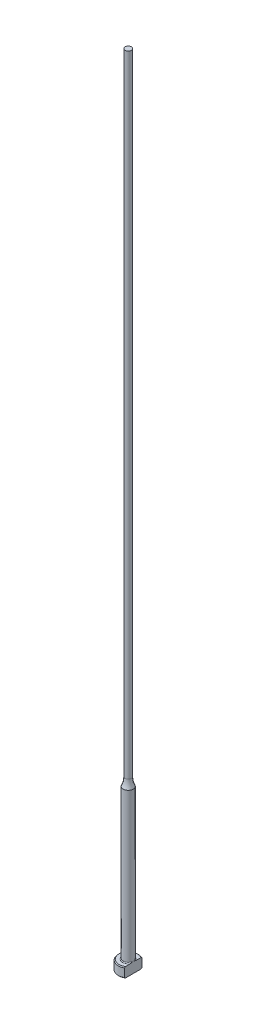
ISO-10303-21;
HEADER;
FILE_DESCRIPTION(('STEP AP214'),'2;1');
FILE_NAME('part.step','',(''),(''),'','','');
FILE_SCHEMA(('AUTOMOTIVE_DESIGN { 1 0 10303 214 1 1 1 1 }'));
ENDSEC;
DATA;
#1=APPLICATION_CONTEXT('core data for automotive mechanical design processes');
#2=APPLICATION_PROTOCOL_DEFINITION('international standard','automotive_design',2000,#1);
#3=PRODUCT_CONTEXT('',#1,'mechanical');
#4=PRODUCT('Part','Part','',(#3));
#5=PRODUCT_RELATED_PRODUCT_CATEGORY('part','',(#4));
#6=PRODUCT_DEFINITION_FORMATION('','',#4);
#7=PRODUCT_DEFINITION_CONTEXT('part definition',#1,'design');
#8=PRODUCT_DEFINITION('design','',#6,#7);
#9=PRODUCT_DEFINITION_SHAPE('','',#8);
#10=(LENGTH_UNIT() NAMED_UNIT(*) SI_UNIT(.MILLI.,.METRE.));
#11=(NAMED_UNIT(*) PLANE_ANGLE_UNIT() SI_UNIT($,.RADIAN.));
#12=(NAMED_UNIT(*) SI_UNIT($,.STERADIAN.) SOLID_ANGLE_UNIT());
#13=UNCERTAINTY_MEASURE_WITH_UNIT(LENGTH_MEASURE(1.E-05),#10,'distance_accuracy_value','');
#14=(GEOMETRIC_REPRESENTATION_CONTEXT(3) GLOBAL_UNCERTAINTY_ASSIGNED_CONTEXT((#13)) GLOBAL_UNIT_ASSIGNED_CONTEXT((#10,
#11,#12)) REPRESENTATION_CONTEXT('',''));
#15=CARTESIAN_POINT('',(0.,0.,0.));
#16=DIRECTION('',(0.,0.,1.));
#17=DIRECTION('',(1.,0.,0.));
#18=AXIS2_PLACEMENT_3D('',#15,#16,#17);
#19=CARTESIAN_POINT('',(-3.17499999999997,3.175,0.));
#20=DIRECTION('',(0.,1.,0.));
#21=DIRECTION('',(0.,0.,1.));
#22=AXIS2_PLACEMENT_3D('',#19,#20,#21);
#23=PLANE('',#22);
#24=CARTESIAN_POINT('',(0.,3.175,0.));
#25=DIRECTION('',(0.,1.,0.));
#26=DIRECTION('',(0.,0.,1.));
#27=AXIS2_PLACEMENT_3D('',#24,#25,#26);
#28=CIRCLE('',#27,2.92099999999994);
#29=CARTESIAN_POINT('',(1.58749999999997,3.175,-2.45195529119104));
#30=VERTEX_POINT('',#29);
#31=CARTESIAN_POINT('',(1.58749999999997,3.175,2.45195529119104));
#32=VERTEX_POINT('',#31);
#33=EDGE_CURVE('E105',#30,#32,#28,.T.);
#34=ORIENTED_EDGE('',*,*,#33,.T.);
#35=DIRECTION('',(0.,0.,1.));
#36=VECTOR('',#35,1.);
#37=CARTESIAN_POINT('',(1.58749999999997,3.17499999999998,2.74963065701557));
#38=LINE('',#37,#36);
#39=CARTESIAN_POINT('',(1.58749999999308,3.175,0.933255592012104));
#40=VERTEX_POINT('',#39);
#41=EDGE_CURVE('E126',#40,#32,#38,.T.);
#42=ORIENTED_EDGE('',*,*,#41,.F.);
#43=CARTESIAN_POINT('',(0.,3.175,0.));
#44=DIRECTION('',(0.,1.,0.));
#45=DIRECTION('',(0.,0.,1.));
#46=AXIS2_PLACEMENT_3D('',#43,#44,#45);
#47=CIRCLE('',#46,1.84149999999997);
#48=CARTESIAN_POINT('',(1.58749999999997,3.17500000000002,-0.933255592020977));
#49=VERTEX_POINT('',#48);
#50=EDGE_CURVE('E11',#40,#49,#47,.F.);
#51=ORIENTED_EDGE('',*,*,#50,.T.);
#52=EDGE_CURVE('E52',#30,#49,#38,.T.);
#53=ORIENTED_EDGE('',*,*,#52,.F.);
#54=EDGE_LOOP('',(#34,#42,#51,#53));
#55=FACE_BOUND('',#54,.T.);
#56=ADVANCED_FACE('F32',(#55),#23,.T.);
#57=CARTESIAN_POINT('',(0.,259.958771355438,0.));
#58=DIRECTION('',(0.,1.,0.));
#59=DIRECTION('',(0.,0.,1.));
#60=AXIS2_PLACEMENT_3D('',#57,#58,#59);
#61=CYLINDRICAL_SURFACE('',#60,3.17499999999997);
#62=CARTESIAN_POINT('',(0.,2.92100000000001,0.));
#63=DIRECTION('',(0.,1.,0.));
#64=DIRECTION('',(0.,0.,1.));
#65=AXIS2_PLACEMENT_3D('',#62,#63,#64);
#66=CIRCLE('',#65,3.17499999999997);
#67=CARTESIAN_POINT('',(1.58749999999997,2.92100000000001,2.74963065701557));
#68=VERTEX_POINT('',#67);
#69=CARTESIAN_POINT('',(1.58749999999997,2.92100000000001,-2.74963065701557));
#70=VERTEX_POINT('',#69);
#71=EDGE_CURVE('E98',#68,#70,#66,.F.);
#72=ORIENTED_EDGE('',*,*,#71,.T.);
#73=DIRECTION('',(0.,-1.,0.));
#74=VECTOR('',#73,1.);
#75=CARTESIAN_POINT('',(1.58749999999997,254.001,-2.74963065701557));
#76=LINE('',#75,#74);
#77=CARTESIAN_POINT('',(1.58749999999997,0.253999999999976,-2.74963065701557));
#78=VERTEX_POINT('',#77);
#79=EDGE_CURVE('E141',#70,#78,#76,.T.);
#80=ORIENTED_EDGE('',*,*,#79,.T.);
#81=CARTESIAN_POINT('',(0.,0.253999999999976,0.));
#82=DIRECTION('',(0.,-1.,0.));
#83=DIRECTION('',(0.,0.,-1.));
#84=AXIS2_PLACEMENT_3D('',#81,#82,#83);
#85=CIRCLE('',#84,3.17499999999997);
#86=CARTESIAN_POINT('',(1.58749999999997,0.253999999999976,2.74963065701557));
#87=VERTEX_POINT('',#86);
#88=EDGE_CURVE('E95',#78,#87,#85,.F.);
#89=ORIENTED_EDGE('',*,*,#88,.T.);
#90=DIRECTION('',(0.,-1.,0.));
#91=VECTOR('',#90,1.);
#92=CARTESIAN_POINT('',(1.58749999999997,254.001,2.74963065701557));
#93=LINE('',#92,#91);
#94=EDGE_CURVE('E88',#68,#87,#93,.T.);
#95=ORIENTED_EDGE('',*,*,#94,.F.);
#96=EDGE_LOOP('',(#72,#80,#89,#95));
#97=FACE_BOUND('',#96,.T.);
#98=ADVANCED_FACE('F191',(#97),#61,.T.);
#99=CARTESIAN_POINT('',(0.,0.,0.));
#100=DIRECTION('',(0.,-1.,0.));
#101=DIRECTION('',(0.,0.,-1.));
#102=AXIS2_PLACEMENT_3D('',#99,#100,#101);
#103=PLANE('',#102);
#104=CARTESIAN_POINT('',(0.,0.,0.));
#105=DIRECTION('',(0.,-1.,0.));
#106=DIRECTION('',(0.,0.,-1.));
#107=AXIS2_PLACEMENT_3D('',#104,#105,#106);
#108=CIRCLE('',#107,2.92100000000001);
#109=CARTESIAN_POINT('',(1.58749999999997,0.,2.45195529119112));
#110=VERTEX_POINT('',#109);
#111=CARTESIAN_POINT('',(1.58749999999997,0.,-2.45195529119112));
#112=VERTEX_POINT('',#111);
#113=EDGE_CURVE('E93',#110,#112,#108,.T.);
#114=ORIENTED_EDGE('',*,*,#113,.T.);
#115=DIRECTION('',(0.,0.,1.));
#116=VECTOR('',#115,1.);
#117=CARTESIAN_POINT('',(1.58749999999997,0.,2.74963065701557));
#118=LINE('',#117,#116);
#119=EDGE_CURVE('E78',#112,#110,#118,.T.);
#120=ORIENTED_EDGE('',*,*,#119,.T.);
#121=EDGE_LOOP('',(#114,#120));
#122=FACE_BOUND('',#121,.T.);
#123=ADVANCED_FACE('F97',(#122),#103,.T.);
#124=CARTESIAN_POINT('',(0.,3.17499999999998,0.));
#125=DIRECTION('',(0.,-1.,0.));
#126=DIRECTION('',(0.,0.,-1.));
#127=AXIS2_PLACEMENT_3D('',#124,#125,#126);
#128=CONICAL_SURFACE('',#127,2.92099999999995,0.785398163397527);
#129=ORIENTED_EDGE('',*,*,#71,.F.);
#130=CARTESIAN_POINT('',(1.58749999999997,-0.16162066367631,-6.0529050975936));
#131=CARTESIAN_POINT('',(1.58749999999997,-0.0288893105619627,-5.91567682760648));
#132=CARTESIAN_POINT('',(1.58749999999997,0.103699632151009,-5.7783103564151));
#133=CARTESIAN_POINT('',(1.58749999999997,0.368508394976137,-5.50321874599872));
#134=CARTESIAN_POINT('',(1.58749999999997,0.500728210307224,-5.36549360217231));
#135=CARTESIAN_POINT('',(1.58749999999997,0.764778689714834,-5.08953516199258));
#136=CARTESIAN_POINT('',(1.58749999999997,0.896609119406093,-4.9513016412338));
#137=CARTESIAN_POINT('',(1.58749999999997,1.15968706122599,-4.67428233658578));
#138=CARTESIAN_POINT('',(1.58749999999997,1.29093457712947,-4.53549655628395));
#139=CARTESIAN_POINT('',(1.58749999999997,1.55007705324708,-4.25997724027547));
#140=CARTESIAN_POINT('',(1.58749999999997,1.67798684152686,-4.12325766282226));
#141=CARTESIAN_POINT('',(1.58749999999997,1.9328486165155,-3.84892898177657));
#142=CARTESIAN_POINT('',(1.58749999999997,2.05980060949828,-3.71131988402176));
#143=CARTESIAN_POINT('',(1.58749999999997,2.31237508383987,-3.43493978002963));
#144=CARTESIAN_POINT('',(1.58749999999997,2.43799784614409,-3.29616903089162));
#145=CARTESIAN_POINT('',(1.58749999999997,2.68741369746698,-3.01699558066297));
#146=CARTESIAN_POINT('',(1.58749999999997,2.81120686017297,-2.8765929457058));
#147=CARTESIAN_POINT('',(1.58749999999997,3.00875865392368,-2.64816703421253));
#148=CARTESIAN_POINT('',(1.58749999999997,3.08336151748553,-2.56087478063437));
#149=CARTESIAN_POINT('',(1.58749999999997,3.2312387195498,-2.38515423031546));
#150=CARTESIAN_POINT('',(1.58749999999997,3.30451292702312,-2.29672582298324));
#151=CARTESIAN_POINT('',(1.58749999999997,3.45004422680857,-2.1174740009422));
#152=CARTESIAN_POINT('',(1.58749999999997,3.5222823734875,-2.02663514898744));
#153=CARTESIAN_POINT('',(1.58749999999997,3.66423097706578,-1.8430252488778));
#154=CARTESIAN_POINT('',(1.58749999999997,3.73394203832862,-1.75025467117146));
#155=CARTESIAN_POINT('',(1.58749999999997,3.87080633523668,-1.5606747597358));
#156=CARTESIAN_POINT('',(1.58749999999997,3.93790459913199,-1.46382547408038));
#157=CARTESIAN_POINT('',(1.58749999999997,4.06669147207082,-1.26632594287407));
#158=CARTESIAN_POINT('',(1.58749999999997,4.1283726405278,-1.16567073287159));
#159=CARTESIAN_POINT('',(1.58749999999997,4.21402252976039,-1.01165766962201));
#160=CARTESIAN_POINT('',(1.58749999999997,4.24127929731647,-0.960142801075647));
#161=CARTESIAN_POINT('',(1.58749999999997,4.2930979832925,-0.855780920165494));
#162=CARTESIAN_POINT('',(1.58749999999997,4.31765941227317,-0.802933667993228));
#163=CARTESIAN_POINT('',(1.58749999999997,4.38614656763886,-0.642461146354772));
#164=CARTESIAN_POINT('',(1.58749999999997,4.42510149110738,-0.532518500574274));
#165=CARTESIAN_POINT('',(1.58749999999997,4.46726244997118,-0.367680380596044));
#166=CARTESIAN_POINT('',(1.58749999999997,4.47844427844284,-0.314802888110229));
#167=CARTESIAN_POINT('',(1.58749999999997,4.49576654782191,-0.208209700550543));
#168=CARTESIAN_POINT('',(1.58749999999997,4.50190743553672,-0.154494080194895));
#169=CARTESIAN_POINT('',(1.58749999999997,4.50871296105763,-0.0468792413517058));
#170=CARTESIAN_POINT('',(1.58749999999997,4.5093945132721,0.00701889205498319));
#171=CARTESIAN_POINT('',(1.58749999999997,4.50527679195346,0.114606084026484));
#172=CARTESIAN_POINT('',(1.58749999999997,4.50047706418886,0.168295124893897));
#173=CARTESIAN_POINT('',(1.58749999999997,4.48579689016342,0.27448544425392));
#174=CARTESIAN_POINT('',(1.58749999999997,4.47596081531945,0.32699298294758));
#175=CARTESIAN_POINT('',(1.58749999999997,4.45181809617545,0.430974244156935));
#176=CARTESIAN_POINT('',(1.58749999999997,4.4375096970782,0.482447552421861));
#177=CARTESIAN_POINT('',(1.58749999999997,4.40502489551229,0.584460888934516));
#178=CARTESIAN_POINT('',(1.58749999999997,4.386827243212,0.634994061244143));
#179=CARTESIAN_POINT('',(1.58749999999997,4.34729308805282,0.734789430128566));
#180=CARTESIAN_POINT('',(1.58749999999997,4.3259572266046,0.784051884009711));
#181=CARTESIAN_POINT('',(1.58749999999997,4.25791922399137,0.930549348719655));
#182=CARTESIAN_POINT('',(1.58749999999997,4.20736047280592,1.0259880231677));
#183=CARTESIAN_POINT('',(1.58749999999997,4.0995545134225,1.21304313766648));
#184=CARTESIAN_POINT('',(1.58749999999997,4.04229912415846,1.30465471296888));
#185=CARTESIAN_POINT('',(1.58749999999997,3.92308746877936,1.48526211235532));
#186=CARTESIAN_POINT('',(1.58749999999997,3.86111349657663,1.57424615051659));
#187=CARTESIAN_POINT('',(1.58749999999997,3.73408621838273,1.74990003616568));
#188=CARTESIAN_POINT('',(1.58749999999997,3.66903444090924,1.83657099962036));
#189=CARTESIAN_POINT('',(1.58749999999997,3.53583371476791,2.00931764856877));
#190=CARTESIAN_POINT('',(1.58749999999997,3.46765527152,2.09537048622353));
#191=CARTESIAN_POINT('',(1.58749999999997,3.32960643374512,2.26611736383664));
#192=CARTESIAN_POINT('',(1.58749999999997,3.25973586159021,2.35081125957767));
#193=CARTESIAN_POINT('',(1.58749999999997,3.04858139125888,2.60290121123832));
#194=CARTESIAN_POINT('',(1.58749999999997,2.90542388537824,2.76872537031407));
#195=CARTESIAN_POINT('',(1.58749999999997,2.64069522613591,3.06970913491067));
#196=CARTESIAN_POINT('',(1.58749999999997,2.51959458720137,3.20528660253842));
#197=CARTESIAN_POINT('',(1.58749999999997,2.27590400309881,3.47510321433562));
#198=CARTESIAN_POINT('',(1.58749999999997,2.15331401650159,3.60934232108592));
#199=CARTESIAN_POINT('',(1.58749999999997,1.90694239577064,3.87695374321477));
#200=CARTESIAN_POINT('',(1.58749999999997,1.78315974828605,4.0103251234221));
#201=CARTESIAN_POINT('',(1.58749999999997,1.53478104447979,4.27630880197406));
#202=CARTESIAN_POINT('',(1.58749999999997,1.41018498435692,4.40892109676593));
#203=CARTESIAN_POINT('',(1.58749999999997,1.0457468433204,4.79499418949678));
#204=CARTESIAN_POINT('',(1.58749999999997,0.80507680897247,5.04767313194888));
#205=CARTESIAN_POINT('',(1.58749999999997,0.443121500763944,5.42550911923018));
#206=CARTESIAN_POINT('',(1.58749999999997,0.322378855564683,5.55118772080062));
#207=CARTESIAN_POINT('',(1.58749999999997,0.0805914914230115,5.80225207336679));
#208=CARTESIAN_POINT('',(1.58749999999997,-0.040453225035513,5.92763782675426));
#209=CARTESIAN_POINT('',(1.58749999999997,-0.161620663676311,6.0529050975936));
#210=B_SPLINE_CURVE_WITH_KNOTS('',3,(#130,#131,#132,#133,#134,#135,#136,#137,#138,#139,#140,
#141,#142,#143,#144,#145,#146,#147,#148,#149,#150,#151,#152,#153,#154,#155,#156,#157,#158,#159,
#160,#161,#162,#163,#164,#165,#166,#167,#168,#169,#170,#171,#172,#173,#174,#175,#176,#177,#178,
#179,#180,#181,#182,#183,#184,#185,#186,#187,#188,#189,#190,#191,#192,#193,#194,#195,#196,#197,
#198,#199,#200,#201,#202,#203,#204,#205,#206,#207,#208,#209),.UNSPECIFIED.,.F.,.F.,(4,2,2,2,2,2,
2,2,2,2,2,2,2,2,2,2,2,2,2,2,2,2,2,2,2,2,2,2,2,2,2,2,2,2,2,2,2,2,2,4),(0.,0.572750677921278,
1.14550874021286,1.71856057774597,2.29160869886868,2.85328006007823,3.4149477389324,
3.97649423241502,4.53801804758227,4.88249307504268,5.22700189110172,5.5751532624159,
5.92322081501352,6.27657800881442,6.63041319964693,6.80518126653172,6.9799810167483,
7.3282426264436,7.49018491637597,7.65211285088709,7.81353889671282,7.97497832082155,
8.13501929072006,8.29512313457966,8.45612518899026,8.61709438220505,8.94062993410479,
9.2645649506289,9.58978187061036,9.91483894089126,10.2441741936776,10.5735441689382,
11.2306812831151,11.7760337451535,12.3214014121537,12.8672825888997,13.4131663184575,
14.4600164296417,14.9828595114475,15.5056983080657),.UNSPECIFIED.);
#211=EDGE_CURVE('E118',#32,#68,#210,.T.);
#212=ORIENTED_EDGE('',*,*,#211,.F.);
#213=ORIENTED_EDGE('',*,*,#33,.F.);
#214=EDGE_CURVE('E117',#70,#30,#210,.T.);
#215=ORIENTED_EDGE('',*,*,#214,.F.);
#216=EDGE_LOOP('',(#129,#212,#213,#215));
#217=FACE_BOUND('',#216,.T.);
#218=ADVANCED_FACE('F162',(#217),#128,.T.);
#219=CARTESIAN_POINT('',(0.,0.253999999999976,0.));
#220=DIRECTION('',(0.,1.,0.));
#221=DIRECTION('',(0.,0.,1.));
#222=AXIS2_PLACEMENT_3D('',#219,#220,#221);
#223=CONICAL_SURFACE('',#222,3.17499999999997,0.785398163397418);
#224=ORIENTED_EDGE('',*,*,#88,.F.);
#225=CARTESIAN_POINT('',(1.58749999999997,3.33662066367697,6.0529050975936));
#226=CARTESIAN_POINT('',(1.58749999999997,3.20388931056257,5.91567682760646));
#227=CARTESIAN_POINT('',(1.58749999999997,3.07130036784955,5.77831035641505));
#228=CARTESIAN_POINT('',(1.58749999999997,2.80649160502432,5.50321874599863));
#229=CARTESIAN_POINT('',(1.58749999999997,2.67427178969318,5.3654936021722));
#230=CARTESIAN_POINT('',(1.58749999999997,2.41022131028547,5.08953516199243));
#231=CARTESIAN_POINT('',(1.58749999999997,2.27839088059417,4.95130164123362));
#232=CARTESIAN_POINT('',(1.58749999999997,2.01531293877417,4.67428233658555));
#233=CARTESIAN_POINT('',(1.58749999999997,1.88406542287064,4.5354965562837));
#234=CARTESIAN_POINT('',(1.58749999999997,1.62492294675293,4.25997724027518));
#235=CARTESIAN_POINT('',(1.58749999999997,1.49701315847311,4.12325766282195));
#236=CARTESIAN_POINT('',(1.58749999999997,1.24215138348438,3.84892898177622));
#237=CARTESIAN_POINT('',(1.58749999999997,1.11519939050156,3.71131988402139));
#238=CARTESIAN_POINT('',(1.58749999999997,0.862624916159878,3.43493978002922));
#239=CARTESIAN_POINT('',(1.58749999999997,0.737002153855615,3.29616903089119));
#240=CARTESIAN_POINT('',(1.58749999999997,0.487586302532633,3.01699558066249));
#241=CARTESIAN_POINT('',(1.58749999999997,0.363793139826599,2.8765929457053));
#242=CARTESIAN_POINT('',(1.58749999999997,0.166241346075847,2.64816703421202));
#243=CARTESIAN_POINT('',(1.58749999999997,0.0916384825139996,2.56087478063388));
#244=CARTESIAN_POINT('',(1.58749999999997,-0.0562387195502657,2.385154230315));
#245=CARTESIAN_POINT('',(1.58749999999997,-0.129512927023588,2.29672582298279));
#246=CARTESIAN_POINT('',(1.58749999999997,-0.27504422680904,2.11747400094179));
#247=CARTESIAN_POINT('',(1.58749999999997,-0.347282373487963,2.02663514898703));
#248=CARTESIAN_POINT('',(1.58749999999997,-0.489230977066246,1.84302524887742));
#249=CARTESIAN_POINT('',(1.58749999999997,-0.558942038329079,1.7502546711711));
#250=CARTESIAN_POINT('',(1.58749999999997,-0.695806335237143,1.56067475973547));
#251=CARTESIAN_POINT('',(1.58749999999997,-0.762904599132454,1.46382547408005));
#252=CARTESIAN_POINT('',(1.58749999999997,-0.891691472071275,1.26632594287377));
#253=CARTESIAN_POINT('',(1.58749999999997,-0.953372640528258,1.16567073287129));
#254=CARTESIAN_POINT('',(1.58749999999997,-1.03902252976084,1.01165766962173));
#255=CARTESIAN_POINT('',(1.58749999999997,-1.06627929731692,0.960142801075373));
#256=CARTESIAN_POINT('',(1.58749999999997,-1.11809798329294,0.85578092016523));
#257=CARTESIAN_POINT('',(1.58749999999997,-1.14265941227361,0.802933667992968));
#258=CARTESIAN_POINT('',(1.58749999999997,-1.21114656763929,0.642461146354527));
#259=CARTESIAN_POINT('',(1.58749999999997,-1.2501014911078,0.532518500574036));
#260=CARTESIAN_POINT('',(1.58749999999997,-1.29226244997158,0.367680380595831));
#261=CARTESIAN_POINT('',(1.58749999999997,-1.30344427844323,0.314802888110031));
#262=CARTESIAN_POINT('',(1.58749999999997,-1.32076654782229,0.208209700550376));
#263=CARTESIAN_POINT('',(1.58749999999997,-1.3269074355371,0.154494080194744));
#264=CARTESIAN_POINT('',(1.58749999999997,-1.333712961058,0.0468792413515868));
#265=CARTESIAN_POINT('',(1.58749999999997,-1.33439451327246,-0.00701889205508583));
#266=CARTESIAN_POINT('',(1.58749999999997,-1.33027679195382,-0.114606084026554));
#267=CARTESIAN_POINT('',(1.58749999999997,-1.32547706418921,-0.168295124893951));
#268=CARTESIAN_POINT('',(1.58749999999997,-1.31079689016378,-0.274485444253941));
#269=CARTESIAN_POINT('',(1.58749999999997,-1.3009608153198,-0.326992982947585));
#270=CARTESIAN_POINT('',(1.58749999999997,-1.27681809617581,-0.430974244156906));
#271=CARTESIAN_POINT('',(1.58749999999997,-1.26250969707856,-0.482447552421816));
#272=CARTESIAN_POINT('',(1.58749999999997,-1.23002489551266,-0.584460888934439));
#273=CARTESIAN_POINT('',(1.58749999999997,-1.21182724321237,-0.634994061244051));
#274=CARTESIAN_POINT('',(1.58749999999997,-1.1722930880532,-0.734789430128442));
#275=CARTESIAN_POINT('',(1.58749999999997,-1.15095722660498,-0.784051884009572));
#276=CARTESIAN_POINT('',(1.58749999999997,-1.08291922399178,-0.93054934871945));
#277=CARTESIAN_POINT('',(1.58749999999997,-1.03236047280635,-1.02598802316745));
#278=CARTESIAN_POINT('',(1.58749999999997,-0.924554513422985,-1.21304313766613));
#279=CARTESIAN_POINT('',(1.58749999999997,-0.86729912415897,-1.30465471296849));
#280=CARTESIAN_POINT('',(1.58749999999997,-0.748087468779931,-1.48526211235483));
#281=CARTESIAN_POINT('',(1.58749999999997,-0.686113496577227,-1.57424615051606));
#282=CARTESIAN_POINT('',(1.58749999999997,-0.55908621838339,-1.74990003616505));
#283=CARTESIAN_POINT('',(1.58749999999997,-0.494034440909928,-1.83657099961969));
#284=CARTESIAN_POINT('',(1.58749999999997,-0.360833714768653,-2.00931764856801));
#285=CARTESIAN_POINT('',(1.58749999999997,-0.292655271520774,-2.09537048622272));
#286=CARTESIAN_POINT('',(1.58749999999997,-0.154606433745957,-2.26611736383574));
#287=CARTESIAN_POINT('',(1.58749999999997,-0.0847358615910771,-2.35081125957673));
#288=CARTESIAN_POINT('',(1.58749999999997,0.126418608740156,-2.60290121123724));
#289=CARTESIAN_POINT('',(1.58749999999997,0.269576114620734,-2.76872537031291));
#290=CARTESIAN_POINT('',(1.58749999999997,0.534304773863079,-3.06970913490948));
#291=CARTESIAN_POINT('',(1.58749999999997,0.655405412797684,-3.20528660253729));
#292=CARTESIAN_POINT('',(1.58749999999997,0.899095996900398,-3.47510321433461));
#293=CARTESIAN_POINT('',(1.58749999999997,1.02168598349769,-3.60934232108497));
#294=CARTESIAN_POINT('',(1.58749999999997,1.26805760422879,-3.87695374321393));
#295=CARTESIAN_POINT('',(1.58749999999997,1.39184025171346,-4.01032512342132));
#296=CARTESIAN_POINT('',(1.58749999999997,1.64021895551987,-4.2763088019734));
#297=CARTESIAN_POINT('',(1.58749999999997,1.76481501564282,-4.40892109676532));
#298=CARTESIAN_POINT('',(1.58749999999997,2.12925315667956,-4.79499418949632));
#299=CARTESIAN_POINT('',(1.58749999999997,2.36992319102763,-5.04767313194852));
#300=CARTESIAN_POINT('',(1.58749999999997,2.73187849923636,-5.42550911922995));
#301=CARTESIAN_POINT('',(1.58749999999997,2.85262114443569,-5.55118772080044));
#302=CARTESIAN_POINT('',(1.58749999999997,3.09440850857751,-5.8022520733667));
#303=CARTESIAN_POINT('',(1.58749999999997,3.2154532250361,-5.92763782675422));
#304=CARTESIAN_POINT('',(1.58749999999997,3.33662066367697,-6.0529050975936));
#305=B_SPLINE_CURVE_WITH_KNOTS('',3,(#225,#226,#227,#228,#229,#230,#231,#232,#233,#234,#235,
#236,#237,#238,#239,#240,#241,#242,#243,#244,#245,#246,#247,#248,#249,#250,#251,#252,#253,#254,
#255,#256,#257,#258,#259,#260,#261,#262,#263,#264,#265,#266,#267,#268,#269,#270,#271,#272,#273,
#274,#275,#276,#277,#278,#279,#280,#281,#282,#283,#284,#285,#286,#287,#288,#289,#290,#291,#292,
#293,#294,#295,#296,#297,#298,#299,#300,#301,#302,#303,#304),.UNSPECIFIED.,.F.,.F.,(4,2,2,2,2,2,
2,2,2,2,2,2,2,2,2,2,2,2,2,2,2,2,2,2,2,2,2,2,2,2,2,2,2,2,2,2,2,2,2,4),(0.,0.57275067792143,
1.14550874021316,1.71856057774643,2.29160869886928,2.85328006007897,3.41494773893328,
3.97649423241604,4.53801804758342,4.88249307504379,5.2270018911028,5.57515326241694,
5.92322081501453,6.27657800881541,6.63041319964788,6.80518126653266,6.97998101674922,
7.32824262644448,7.49018491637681,7.65211285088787,7.81353889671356,7.97497832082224,
8.1350192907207,8.29512313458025,8.45612518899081,8.61709438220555,8.94062993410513,
9.26456495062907,9.58978187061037,9.91483894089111,10.2441741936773,10.5735441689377,
11.2306812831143,11.776033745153,12.3214014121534,12.8672825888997,13.4131663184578,
14.4600164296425,14.9828595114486,15.505698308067),.UNSPECIFIED.);
#306=EDGE_CURVE('E81',#112,#78,#305,.T.);
#307=ORIENTED_EDGE('',*,*,#306,.F.);
#308=ORIENTED_EDGE('',*,*,#113,.F.);
#309=EDGE_CURVE('E84',#87,#110,#305,.T.);
#310=ORIENTED_EDGE('',*,*,#309,.F.);
#311=EDGE_LOOP('',(#224,#307,#308,#310));
#312=FACE_BOUND('',#311,.T.);
#313=ADVANCED_FACE('F92',(#312),#223,.T.);
#314=CARTESIAN_POINT('',(0.,3.42900000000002,0.));
#315=DIRECTION('',(0.,1.,0.));
#316=DIRECTION('',(0.,0.,1.));
#317=AXIS2_PLACEMENT_3D('',#314,#315,#316);
#318=TOROIDAL_SURFACE('',#317,1.84149999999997,0.254);
#319=CARTESIAN_POINT('',(1.58749999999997,3.42900000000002,0.));
#320=CARTESIAN_POINT('',(1.58749999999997,3.42899942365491,-1.9220514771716E-10));
#321=CARTESIAN_POINT('',(1.58749999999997,3.42899884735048,-1.2261161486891E-07));
#322=CARTESIAN_POINT('',(1.58749999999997,3.42899773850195,-5.09676365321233E-07));
#323=CARTESIAN_POINT('',(1.58749999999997,3.42899720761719,-7.78176328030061E-07));
#324=CARTESIAN_POINT('',(1.58749999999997,3.42899614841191,-1.42307272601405E-06));
#325=CARTESIAN_POINT('',(1.58749999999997,3.42899562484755,-1.80713867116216E-06));
#326=CARTESIAN_POINT('',(1.58749999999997,3.42899463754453,-2.63494846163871E-06));
#327=CARTESIAN_POINT('',(1.58749999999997,3.42899417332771,-3.07814756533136E-06));
#328=CARTESIAN_POINT('',(1.58749999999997,3.42899261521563,-4.66897357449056E-06));
#329=CARTESIAN_POINT('',(1.58749999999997,3.42899159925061,-5.89404908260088E-06));
#330=CARTESIAN_POINT('',(1.58749999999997,3.42898979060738,-8.42427511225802E-06));
#331=CARTESIAN_POINT('',(1.58749999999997,3.42898899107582,-9.7248057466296E-06));
#332=CARTESIAN_POINT('',(1.58749999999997,3.42898598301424,-1.48060601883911E-05));
#333=CARTESIAN_POINT('',(1.58749999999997,3.42898393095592,-1.86838281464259E-05));
#334=CARTESIAN_POINT('',(1.58749999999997,3.42898057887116,-2.63261117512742E-05));
#335=CARTESIAN_POINT('',(1.58749999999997,3.42897922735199,-3.00687417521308E-05));
#336=CARTESIAN_POINT('',(1.58749999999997,3.42897347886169,-4.60276298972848E-05));
#337=CARTESIAN_POINT('',(1.58749999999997,3.42896911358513,-5.8247019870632E-05));
#338=CARTESIAN_POINT('',(1.58749999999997,3.42896211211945,-8.11070097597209E-05));
#339=CARTESIAN_POINT('',(1.58749999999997,3.42895931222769,-9.16953114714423E-05));
#340=CARTESIAN_POINT('',(1.58749999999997,3.42893712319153,-0.000168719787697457));
#341=CARTESIAN_POINT('',(1.58749999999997,3.42890881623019,-0.000232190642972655));
#342=CARTESIAN_POINT('',(1.58749999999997,3.42880276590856,-0.000479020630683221));
#343=CARTESIAN_POINT('',(1.58749999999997,3.42873165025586,-0.00066443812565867));
#344=CARTESIAN_POINT('',(1.58749999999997,3.42845137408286,-0.0013844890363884));
#345=CARTESIAN_POINT('',(1.58749999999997,3.42823526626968,-0.00191701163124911));
#346=CARTESIAN_POINT('',(1.58749999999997,3.42735449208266,-0.00409774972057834));
#347=CARTESIAN_POINT('',(1.58749999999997,3.42669768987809,-0.00574830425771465));
#348=CARTESIAN_POINT('',(1.58749999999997,3.4174405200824,-0.0289985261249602));
#349=CARTESIAN_POINT('',(1.58749999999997,3.40878325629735,-0.0505816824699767));
#350=CARTESIAN_POINT('',(1.58749999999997,3.39189297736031,-0.0929947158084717));
#351=CARTESIAN_POINT('',(1.58749999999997,3.38365605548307,-0.11382315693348));
#352=CARTESIAN_POINT('',(1.58749999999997,3.36635393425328,-0.157956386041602));
#353=CARTESIAN_POINT('',(1.58749999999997,3.35730391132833,-0.181267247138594));
#354=CARTESIAN_POINT('',(1.58749999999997,3.33936775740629,-0.228222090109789));
#355=CARTESIAN_POINT('',(1.58749999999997,3.33048420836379,-0.25186705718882));
#356=CARTESIAN_POINT('',(1.58749999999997,3.30894496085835,-0.310512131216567));
#357=CARTESIAN_POINT('',(1.58749999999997,3.29649449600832,-0.345588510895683));
#358=CARTESIAN_POINT('',(1.58749999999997,3.27296975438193,-0.415278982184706));
#359=CARTESIAN_POINT('',(1.58749999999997,3.26186987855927,-0.449884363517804));
#360=CARTESIAN_POINT('',(1.58749999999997,3.2395832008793,-0.524471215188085));
#361=CARTESIAN_POINT('',(1.58749999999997,3.22860862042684,-0.564517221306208));
#362=CARTESIAN_POINT('',(1.58749999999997,3.20902534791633,-0.645529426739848));
#363=CARTESIAN_POINT('',(1.58749999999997,3.20043582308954,-0.686500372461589));
#364=CARTESIAN_POINT('',(1.58749999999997,3.18611712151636,-0.771546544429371));
#365=CARTESIAN_POINT('',(1.58749999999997,3.18059550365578,-0.815658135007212));
#366=CARTESIAN_POINT('',(1.58749999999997,3.17455396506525,-0.904117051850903));
#367=CARTESIAN_POINT('',(1.58749999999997,3.17401361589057,-0.948462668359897));
#368=CARTESIAN_POINT('',(1.58749999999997,3.17898948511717,-1.02531896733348));
#369=CARTESIAN_POINT('',(1.58749999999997,3.1829739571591,-1.05792141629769));
#370=CARTESIAN_POINT('',(1.58749999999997,3.19569167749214,-1.12184393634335));
#371=CARTESIAN_POINT('',(1.58749999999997,3.20436049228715,-1.1531753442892));
#372=CARTESIAN_POINT('',(1.58749999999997,3.22236152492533,-1.19946468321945));
#373=CARTESIAN_POINT('',(1.58749999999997,3.2295150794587,-1.21526783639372));
#374=CARTESIAN_POINT('',(1.58749999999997,3.24587062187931,-1.24583726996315));
#375=CARTESIAN_POINT('',(1.58749999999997,3.25507530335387,-1.26060215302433));
#376=CARTESIAN_POINT('',(1.58749999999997,3.27378481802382,-1.28575815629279));
#377=CARTESIAN_POINT('',(1.58749999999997,3.28289001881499,-1.29644383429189));
#378=CARTESIAN_POINT('',(1.58749999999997,3.30268460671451,-1.31623154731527));
#379=CARTESIAN_POINT('',(1.58749999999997,3.31337067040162,-1.32533681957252));
#380=CARTESIAN_POINT('',(1.58749999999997,3.33349977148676,-1.33941140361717));
#381=CARTESIAN_POINT('',(1.58749999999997,3.34261446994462,-1.34484814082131));
#382=CARTESIAN_POINT('',(1.58749999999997,3.36161455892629,-1.35416329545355));
#383=CARTESIAN_POINT('',(1.58749999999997,3.37149946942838,-1.35804267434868));
#384=CARTESIAN_POINT('',(1.58749999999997,3.39188678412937,-1.36398436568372));
#385=CARTESIAN_POINT('',(1.58749999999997,3.40239309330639,-1.36603350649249));
#386=CARTESIAN_POINT('',(1.58749999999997,3.42360372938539,-1.3680840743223));
#387=CARTESIAN_POINT('',(1.58749999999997,3.43430795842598,-1.36808648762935));
#388=CARTESIAN_POINT('',(1.58749999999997,3.45433283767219,-1.36616208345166));
#389=CARTESIAN_POINT('',(1.58749999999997,3.46367506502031,-1.36444960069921));
#390=CARTESIAN_POINT('',(1.58749999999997,3.48195519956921,-1.35953338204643));
#391=CARTESIAN_POINT('',(1.58749999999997,3.49089304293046,-1.3563294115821));
#392=CARTESIAN_POINT('',(1.58749999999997,3.50850302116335,-1.34848006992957));
#393=CARTESIAN_POINT('',(1.58749999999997,3.5171531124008,-1.34378578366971));
#394=CARTESIAN_POINT('',(1.58749999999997,3.53371257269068,-1.33324445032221));
#395=CARTESIAN_POINT('',(1.58749999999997,3.54162163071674,-1.32739692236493));
#396=CARTESIAN_POINT('',(1.58749999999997,3.56107121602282,-1.31107304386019));
#397=CARTESIAN_POINT('',(1.58749999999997,3.57202221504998,-1.29989286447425));
#398=CARTESIAN_POINT('',(1.58749999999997,3.59202509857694,-1.27593566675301));
#399=CARTESIAN_POINT('',(1.58749999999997,3.60107086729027,-1.26315370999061));
#400=CARTESIAN_POINT('',(1.58749999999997,3.62186023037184,-1.22930733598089));
#401=CARTESIAN_POINT('',(1.58749999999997,3.63240584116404,-1.20751096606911));
#402=CARTESIAN_POINT('',(1.58749999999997,3.65004643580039,-1.16266144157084));
#403=CARTESIAN_POINT('',(1.58749999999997,3.65714435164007,-1.13960937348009));
#404=CARTESIAN_POINT('',(1.58749999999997,3.67265428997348,-1.07603916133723));
#405=CARTESIAN_POINT('',(1.58749999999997,3.67834921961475,-1.03486686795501));
#406=CARTESIAN_POINT('',(1.58749999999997,3.68382880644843,-0.951558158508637));
#407=CARTESIAN_POINT('',(1.58749999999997,3.68350976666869,-0.909417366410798));
#408=CARTESIAN_POINT('',(1.58749999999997,3.67745397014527,-0.811383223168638));
#409=CARTESIAN_POINT('',(1.58749999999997,3.66993873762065,-0.755610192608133));
#410=CARTESIAN_POINT('',(1.58749999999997,3.64933373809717,-0.644937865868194));
#411=CARTESIAN_POINT('',(1.58749999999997,3.63621897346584,-0.59004364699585));
#412=CARTESIAN_POINT('',(1.58749999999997,3.60740922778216,-0.485757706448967));
#413=CARTESIAN_POINT('',(1.58749999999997,3.59201096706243,-0.436281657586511));
#414=CARTESIAN_POINT('',(1.58749999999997,3.55922497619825,-0.338551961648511));
#415=CARTESIAN_POINT('',(1.58749999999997,3.5418584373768,-0.290291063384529));
#416=CARTESIAN_POINT('',(1.58749999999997,3.51760237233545,-0.225557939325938));
#417=CARTESIAN_POINT('',(1.58749999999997,3.51126413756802,-0.208874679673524));
#418=CARTESIAN_POINT('',(1.58749999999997,3.49830042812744,-0.17512392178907));
#419=CARTESIAN_POINT('',(1.58749999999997,3.49167176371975,-0.158057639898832));
#420=CARTESIAN_POINT('',(1.58749999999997,3.47585523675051,-0.117638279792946));
#421=CARTESIAN_POINT('',(1.58749999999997,3.46662970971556,-0.0943002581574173));
#422=CARTESIAN_POINT('',(1.58749999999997,3.44889695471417,-0.0497824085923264));
#423=CARTESIAN_POINT('',(1.58749999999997,3.44040039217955,-0.028598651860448));
#424=CARTESIAN_POINT('',(1.58749999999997,3.43130364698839,-0.00575168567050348));
#425=CARTESIAN_POINT('',(1.58749999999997,3.43064818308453,-0.00410451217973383));
#426=CARTESIAN_POINT('',(1.58749999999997,3.42976776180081,-0.00192459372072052));
#427=CARTESIAN_POINT('',(1.58749999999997,3.42955062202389,-0.00138952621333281));
#428=CARTESIAN_POINT('',(1.58749999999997,3.42926908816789,-0.000666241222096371));
#429=CARTESIAN_POINT('',(1.58749999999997,3.42919771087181,-0.000480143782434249));
#430=CARTESIAN_POINT('',(1.58749999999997,3.42909131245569,-0.000232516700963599));
#431=CARTESIAN_POINT('',(1.58749999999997,3.42906294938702,-0.000168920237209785));
#432=CARTESIAN_POINT('',(1.58749999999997,3.42904072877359,-9.17527162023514E-05));
#433=CARTESIAN_POINT('',(1.58749999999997,3.42903792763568,-8.11550293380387E-05));
#434=CARTESIAN_POINT('',(1.58749999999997,3.42903091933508,-5.82743948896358E-05));
#435=CARTESIAN_POINT('',(1.58749999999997,3.42902654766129,-4.60440001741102E-05));
#436=CARTESIAN_POINT('',(1.58749999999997,3.42902079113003,-3.00727682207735E-05));
#437=CARTESIAN_POINT('',(1.58749999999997,3.42901943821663,-2.63286807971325E-05));
#438=CARTESIAN_POINT('',(1.58749999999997,3.42901608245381,-1.86836529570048E-05));
#439=CARTESIAN_POINT('',(1.58749999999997,3.4290140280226,-1.48046517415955E-05));
#440=CARTESIAN_POINT('',(1.58749999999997,3.42901101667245,-9.72223943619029E-06));
#441=CARTESIAN_POINT('',(1.58749999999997,3.42901021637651,-8.42159649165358E-06));
#442=CARTESIAN_POINT('',(1.58749999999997,3.42900840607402,-5.89129729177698E-06));
#443=CARTESIAN_POINT('',(1.58749999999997,3.42900738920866,-4.66626867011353E-06));
#444=CARTESIAN_POINT('',(1.58749999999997,3.42900582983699,-3.07568803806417E-06));
#445=CARTESIAN_POINT('',(1.58749999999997,3.42900536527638,-2.63259565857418E-06));
#446=CARTESIAN_POINT('',(1.58749999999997,3.4290043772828,-1.80506085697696E-06));
#447=CARTESIAN_POINT('',(1.58749999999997,3.42900385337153,-1.42116387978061E-06));
#448=CARTESIAN_POINT('',(1.58749999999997,3.42900279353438,-7.76675643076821E-07));
#449=CARTESIAN_POINT('',(1.58749999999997,3.42900226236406,-5.08406487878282E-07));
#450=CARTESIAN_POINT('',(1.58749999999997,3.42900115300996,-1.21901887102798E-07));
#451=CARTESIAN_POINT('',(1.58749999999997,3.42900057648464,1.92251677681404E-10));
#452=CARTESIAN_POINT('',(1.58749999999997,3.42900000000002,0.));
#453=B_SPLINE_CURVE_WITH_KNOTS('',3,(#319,#320,#321,#322,#323,#324,#325,#326,#327,#328,#329,
#330,#331,#332,#333,#334,#335,#336,#337,#338,#339,#340,#341,#342,#343,#344,#345,#346,#347,#348,
#349,#350,#351,#352,#353,#354,#355,#356,#357,#358,#359,#360,#361,#362,#363,#364,#365,#366,#367,
#368,#369,#370,#371,#372,#373,#374,#375,#376,#377,#378,#379,#380,#381,#382,#383,#384,#385,#386,
#387,#388,#389,#390,#391,#392,#393,#394,#395,#396,#397,#398,#399,#400,#401,#402,#403,#404,#405,
#406,#407,#408,#409,#410,#411,#412,#413,#414,#415,#416,#417,#418,#419,#420,#421,#422,#423,#424,
#425,#426,#427,#428,#429,#430,#431,#432,#433,#434,#435,#436,#437,#438,#439,#440,#441,#442,#443,
#444,#445,#446,#447,#448,#449,#450,#451,#452),.UNSPECIFIED.,.T.,.F.,(4,2,2,2,2,2,2,2,2,2,2,2,2,
2,2,2,2,2,2,2,2,2,2,2,2,2,2,2,2,2,2,2,2,2,2,2,2,2,2,2,2,2,2,2,2,2,2,2,2,2,2,2,2,2,2,2,2,2,2,2,2,
2,2,2,2,2,4),(0.,1.72815458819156E-06,3.50429255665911E-06,5.44431004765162E-06,
7.3675525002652E-06,1.2119089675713E-05,1.66953775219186E-05,2.98160400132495E-05,
4.17409564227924E-05,8.0660475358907E-05,0.000113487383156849,0.000321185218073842,
0.000917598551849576,0.00264089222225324,0.00797105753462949,0.0777276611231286,
0.144923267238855,0.219939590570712,0.295714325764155,0.407362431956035,0.516367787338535,
0.640878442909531,0.766362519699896,0.899536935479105,1.03216495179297,1.13045740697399,
1.22743103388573,1.27935899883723,1.33135556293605,1.37333248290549,1.41522237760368,
1.44693946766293,1.47863694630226,1.51056074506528,1.54246916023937,1.57083210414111,
1.59919951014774,1.62861579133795,1.65804436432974,1.70472658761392,1.75155645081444,
1.82378709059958,1.89595619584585,2.01995471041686,2.1460932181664,2.31447224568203,
2.48361094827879,2.6389891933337,2.79283011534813,2.84637031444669,2.9012946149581,
2.97658236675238,3.04504771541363,3.05036697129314,3.05209849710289,3.05269709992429,
3.05290520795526,3.05293806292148,3.05297701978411,3.05298895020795,3.05300207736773,
3.05300665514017,3.0530114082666,3.05301333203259,3.05301527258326,3.05301704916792,
3.05301877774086),.UNSPECIFIED.);
#454=CARTESIAN_POINT('',(1.58749999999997,3.42900000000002,0.));
#455=VERTEX_POINT('',#454);
#456=EDGE_CURVE('E47',#455,#49,#453,.T.);
#457=ORIENTED_EDGE('',*,*,#456,.T.);
#458=ORIENTED_EDGE('',*,*,#50,.F.);
#459=CARTESIAN_POINT('',(1.58749999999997,3.42900000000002,0.));
#460=CARTESIAN_POINT('',(1.58749999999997,3.42900057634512,1.9220512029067E-10));
#461=CARTESIAN_POINT('',(1.58749999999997,3.42900115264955,1.22611614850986E-07));
#462=CARTESIAN_POINT('',(1.58749999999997,3.42900226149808,5.09676365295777E-07));
#463=CARTESIAN_POINT('',(1.58749999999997,3.42900279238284,7.78176328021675E-07));
#464=CARTESIAN_POINT('',(1.58749999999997,3.42900385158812,1.42307272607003E-06));
#465=CARTESIAN_POINT('',(1.58749999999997,3.42900437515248,1.80713867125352E-06));
#466=CARTESIAN_POINT('',(1.58749999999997,3.4290053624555,2.63494846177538E-06));
#467=CARTESIAN_POINT('',(1.58749999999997,3.42900582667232,3.0781475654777E-06));
#468=CARTESIAN_POINT('',(1.58749999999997,3.4290073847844,4.66897357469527E-06));
#469=CARTESIAN_POINT('',(1.58749999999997,3.42900840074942,5.89404908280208E-06));
#470=CARTESIAN_POINT('',(1.58749999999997,3.42901020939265,8.42427511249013E-06));
#471=CARTESIAN_POINT('',(1.58749999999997,3.42901100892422,9.72480574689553E-06));
#472=CARTESIAN_POINT('',(1.58749999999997,3.42901401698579,1.48060601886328E-05));
#473=CARTESIAN_POINT('',(1.58749999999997,3.42901606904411,1.86838281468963E-05));
#474=CARTESIAN_POINT('',(1.58749999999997,3.42901942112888,2.63261117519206E-05));
#475=CARTESIAN_POINT('',(1.58749999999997,3.42902077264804,3.00687417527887E-05));
#476=CARTESIAN_POINT('',(1.58749999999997,3.42902652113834,4.60276298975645E-05));
#477=CARTESIAN_POINT('',(1.58749999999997,3.4290308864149,5.82470198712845E-05));
#478=CARTESIAN_POINT('',(1.58749999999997,3.42903788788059,8.11070097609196E-05));
#479=CARTESIAN_POINT('',(1.58749999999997,3.42904068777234,9.16953114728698E-05));
#480=CARTESIAN_POINT('',(1.58749999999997,3.4290628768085,0.000168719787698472));
#481=CARTESIAN_POINT('',(1.58749999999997,3.42909118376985,0.000232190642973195));
#482=CARTESIAN_POINT('',(1.58749999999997,3.42919723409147,0.000479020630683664));
#483=CARTESIAN_POINT('',(1.58749999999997,3.42926834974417,0.000664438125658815));
#484=CARTESIAN_POINT('',(1.58749999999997,3.42954862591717,0.00138448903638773));
#485=CARTESIAN_POINT('',(1.58749999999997,3.42976473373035,0.00191701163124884));
#486=CARTESIAN_POINT('',(1.58749999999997,3.43064550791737,0.00409774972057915));
#487=CARTESIAN_POINT('',(1.58749999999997,3.43130231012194,0.00574830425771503));
#488=CARTESIAN_POINT('',(1.58749999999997,3.44055947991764,0.0289985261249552));
#489=CARTESIAN_POINT('',(1.58749999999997,3.44921674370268,0.0505816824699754));
#490=CARTESIAN_POINT('',(1.58749999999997,3.46610702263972,0.0929947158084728));
#491=CARTESIAN_POINT('',(1.58749999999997,3.47434394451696,0.11382315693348));
#492=CARTESIAN_POINT('',(1.58749999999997,3.49164606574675,0.157956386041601));
#493=CARTESIAN_POINT('',(1.58749999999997,3.5006960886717,0.181267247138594));
#494=CARTESIAN_POINT('',(1.58749999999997,3.51863224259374,0.228222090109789));
#495=CARTESIAN_POINT('',(1.58749999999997,3.52751579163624,0.25186705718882));
#496=CARTESIAN_POINT('',(1.58749999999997,3.54905503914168,0.310512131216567));
#497=CARTESIAN_POINT('',(1.58749999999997,3.56150550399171,0.345588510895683));
#498=CARTESIAN_POINT('',(1.58749999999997,3.5850302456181,0.415278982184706));
#499=CARTESIAN_POINT('',(1.58749999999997,3.59613012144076,0.449884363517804));
#500=CARTESIAN_POINT('',(1.58749999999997,3.61841679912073,0.524471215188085));
#501=CARTESIAN_POINT('',(1.58749999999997,3.62939137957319,0.564517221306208));
#502=CARTESIAN_POINT('',(1.58749999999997,3.6489746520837,0.645529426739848));
#503=CARTESIAN_POINT('',(1.58749999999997,3.65756417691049,0.686500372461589));
#504=CARTESIAN_POINT('',(1.58749999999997,3.67188287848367,0.771546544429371));
#505=CARTESIAN_POINT('',(1.58749999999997,3.67740449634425,0.815658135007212));
#506=CARTESIAN_POINT('',(1.58749999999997,3.68344603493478,0.904117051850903));
#507=CARTESIAN_POINT('',(1.58749999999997,3.68398638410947,0.948462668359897));
#508=CARTESIAN_POINT('',(1.58749999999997,3.67901051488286,1.02531896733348));
#509=CARTESIAN_POINT('',(1.58749999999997,3.67502604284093,1.05792141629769));
#510=CARTESIAN_POINT('',(1.58749999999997,3.66230832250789,1.12184393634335));
#511=CARTESIAN_POINT('',(1.58749999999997,3.65363950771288,1.1531753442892));
#512=CARTESIAN_POINT('',(1.58749999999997,3.6356384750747,1.19946468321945));
#513=CARTESIAN_POINT('',(1.58749999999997,3.62848492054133,1.21526783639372));
#514=CARTESIAN_POINT('',(1.58749999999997,3.61212937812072,1.24583726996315));
#515=CARTESIAN_POINT('',(1.58749999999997,3.60292469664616,1.26060215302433));
#516=CARTESIAN_POINT('',(1.58749999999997,3.58421518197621,1.28575815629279));
#517=CARTESIAN_POINT('',(1.58749999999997,3.57510998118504,1.29644383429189));
#518=CARTESIAN_POINT('',(1.58749999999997,3.55531539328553,1.31623154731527));
#519=CARTESIAN_POINT('',(1.58749999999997,3.54462932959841,1.32533681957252));
#520=CARTESIAN_POINT('',(1.58749999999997,3.52450022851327,1.33941140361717));
#521=CARTESIAN_POINT('',(1.58749999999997,3.51538553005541,1.34484814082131));
#522=CARTESIAN_POINT('',(1.58749999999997,3.49638544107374,1.35416329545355));
#523=CARTESIAN_POINT('',(1.58749999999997,3.48650053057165,1.35804267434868));
#524=CARTESIAN_POINT('',(1.58749999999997,3.46611321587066,1.36398436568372));
#525=CARTESIAN_POINT('',(1.58749999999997,3.45560690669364,1.36603350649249));
#526=CARTESIAN_POINT('',(1.58749999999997,3.43439627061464,1.3680840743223));
#527=CARTESIAN_POINT('',(1.58749999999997,3.42369204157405,1.36808648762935));
#528=CARTESIAN_POINT('',(1.58749999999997,3.40366716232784,1.36616208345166));
#529=CARTESIAN_POINT('',(1.58749999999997,3.39432493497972,1.36444960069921));
#530=CARTESIAN_POINT('',(1.58749999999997,3.37604480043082,1.35953338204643));
#531=CARTESIAN_POINT('',(1.58749999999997,3.36710695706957,1.3563294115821));
#532=CARTESIAN_POINT('',(1.58749999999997,3.34949697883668,1.34848006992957));
#533=CARTESIAN_POINT('',(1.58749999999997,3.34084688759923,1.34378578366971));
#534=CARTESIAN_POINT('',(1.58749999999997,3.32428742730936,1.33324445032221));
#535=CARTESIAN_POINT('',(1.58749999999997,3.31637836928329,1.32739692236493));
#536=CARTESIAN_POINT('',(1.58749999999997,3.29692878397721,1.31107304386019));
#537=CARTESIAN_POINT('',(1.58749999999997,3.28597778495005,1.29989286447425));
#538=CARTESIAN_POINT('',(1.58749999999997,3.26597490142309,1.27593566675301));
#539=CARTESIAN_POINT('',(1.58749999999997,3.25692913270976,1.26315370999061));
#540=CARTESIAN_POINT('',(1.58749999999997,3.23613976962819,1.22930733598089));
#541=CARTESIAN_POINT('',(1.58749999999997,3.22559415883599,1.20751096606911));
#542=CARTESIAN_POINT('',(1.58749999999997,3.20795356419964,1.16266144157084));
#543=CARTESIAN_POINT('',(1.58749999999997,3.20085564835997,1.13960937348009));
#544=CARTESIAN_POINT('',(1.58749999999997,3.18534571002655,1.07603916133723));
#545=CARTESIAN_POINT('',(1.58749999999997,3.17965078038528,1.03486686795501));
#546=CARTESIAN_POINT('',(1.58749999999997,3.1741711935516,0.951558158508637));
#547=CARTESIAN_POINT('',(1.58749999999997,3.17449023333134,0.909417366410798));
#548=CARTESIAN_POINT('',(1.58749999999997,3.18054602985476,0.811383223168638));
#549=CARTESIAN_POINT('',(1.58749999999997,3.18806126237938,0.755610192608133));
#550=CARTESIAN_POINT('',(1.58749999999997,3.20866626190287,0.644937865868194));
#551=CARTESIAN_POINT('',(1.58749999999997,3.2217810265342,0.59004364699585));
#552=CARTESIAN_POINT('',(1.58749999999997,3.25059077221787,0.485757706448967));
#553=CARTESIAN_POINT('',(1.58749999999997,3.2659890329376,0.43628165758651));
#554=CARTESIAN_POINT('',(1.58749999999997,3.29877502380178,0.338551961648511));
#555=CARTESIAN_POINT('',(1.58749999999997,3.31614156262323,0.290291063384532));
#556=CARTESIAN_POINT('',(1.58749999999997,3.34039762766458,0.225557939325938));
#557=CARTESIAN_POINT('',(1.58749999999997,3.346735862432,0.208874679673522));
#558=CARTESIAN_POINT('',(1.58749999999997,3.35969957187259,0.175123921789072));
#559=CARTESIAN_POINT('',(1.58749999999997,3.3663282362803,0.15805763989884));
#560=CARTESIAN_POINT('',(1.58749999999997,3.3821447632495,0.117638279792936));
#561=CARTESIAN_POINT('',(1.58749999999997,3.39137029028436,0.0943002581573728));
#562=CARTESIAN_POINT('',(1.58749999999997,3.40910304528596,0.0497824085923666));
#563=CARTESIAN_POINT('',(1.58749999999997,3.41759960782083,0.0285986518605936));
#564=CARTESIAN_POINT('',(1.58749999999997,3.42669635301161,0.00575168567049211));
#565=CARTESIAN_POINT('',(1.58749999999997,3.42735181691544,0.00410451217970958));
#566=CARTESIAN_POINT('',(1.58749999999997,3.42823223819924,0.00192459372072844));
#567=CARTESIAN_POINT('',(1.58749999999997,3.42844937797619,0.00138952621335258));
#568=CARTESIAN_POINT('',(1.58749999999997,3.42873091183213,0.000666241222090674));
#569=CARTESIAN_POINT('',(1.58749999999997,3.42880228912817,0.000480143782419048));
#570=CARTESIAN_POINT('',(1.58749999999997,3.42890868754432,0.000232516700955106));
#571=CARTESIAN_POINT('',(1.58749999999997,3.42893705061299,0.000168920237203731));
#572=CARTESIAN_POINT('',(1.58749999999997,3.42895927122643,9.17527161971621E-05));
#573=CARTESIAN_POINT('',(1.58749999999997,3.42896207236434,8.1155029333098E-05));
#574=CARTESIAN_POINT('',(1.58749999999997,3.42896908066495,5.82743948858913E-05));
#575=CARTESIAN_POINT('',(1.58749999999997,3.42897345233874,4.60440001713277E-05));
#576=CARTESIAN_POINT('',(1.58749999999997,3.42897920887,3.00727682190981E-05));
#577=CARTESIAN_POINT('',(1.58749999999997,3.42898056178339,2.63286807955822E-05));
#578=CARTESIAN_POINT('',(1.58749999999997,3.42898391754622,1.86836529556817E-05));
#579=CARTESIAN_POINT('',(1.58749999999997,3.42898597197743,1.48046517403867E-05));
#580=CARTESIAN_POINT('',(1.58749999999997,3.42898898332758,9.72223943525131E-06));
#581=CARTESIAN_POINT('',(1.58749999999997,3.42898978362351,8.42159649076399E-06));
#582=CARTESIAN_POINT('',(1.58749999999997,3.42899159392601,5.89129729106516E-06));
#583=CARTESIAN_POINT('',(1.58749999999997,3.42899261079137,4.66626866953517E-06));
#584=CARTESIAN_POINT('',(1.58749999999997,3.42899417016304,3.0756880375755E-06));
#585=CARTESIAN_POINT('',(1.58749999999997,3.42899463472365,2.63259565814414E-06));
#586=CARTESIAN_POINT('',(1.58749999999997,3.42899562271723,1.80506085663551E-06));
#587=CARTESIAN_POINT('',(1.58749999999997,3.42899614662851,1.42116387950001E-06));
#588=CARTESIAN_POINT('',(1.58749999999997,3.42899720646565,7.7667564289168E-07));
#589=CARTESIAN_POINT('',(1.58749999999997,3.42899773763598,5.0840648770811E-07));
#590=CARTESIAN_POINT('',(1.58749999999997,3.42899884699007,1.21901887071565E-07));
#591=CARTESIAN_POINT('',(1.58749999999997,3.42899942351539,-1.92251650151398E-10));
#592=CARTESIAN_POINT('',(1.58749999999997,3.42900000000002,0.));
#593=B_SPLINE_CURVE_WITH_KNOTS('',3,(#459,#460,#461,#462,#463,#464,#465,#466,#467,#468,#469,
#470,#471,#472,#473,#474,#475,#476,#477,#478,#479,#480,#481,#482,#483,#484,#485,#486,#487,#488,
#489,#490,#491,#492,#493,#494,#495,#496,#497,#498,#499,#500,#501,#502,#503,#504,#505,#506,#507,
#508,#509,#510,#511,#512,#513,#514,#515,#516,#517,#518,#519,#520,#521,#522,#523,#524,#525,#526,
#527,#528,#529,#530,#531,#532,#533,#534,#535,#536,#537,#538,#539,#540,#541,#542,#543,#544,#545,
#546,#547,#548,#549,#550,#551,#552,#553,#554,#555,#556,#557,#558,#559,#560,#561,#562,#563,#564,
#565,#566,#567,#568,#569,#570,#571,#572,#573,#574,#575,#576,#577,#578,#579,#580,#581,#582,#583,
#584,#585,#586,#587,#588,#589,#590,#591,#592),.UNSPECIFIED.,.T.,.F.,(4,2,2,2,2,2,2,2,2,2,2,2,2,
2,2,2,2,2,2,2,2,2,2,2,2,2,2,2,2,2,2,2,2,2,2,2,2,2,2,2,2,2,2,2,2,2,2,2,2,2,2,2,2,2,2,2,2,2,2,2,2,
2,2,2,2,2,4),(0.,1.72815458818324E-06,3.50429255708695E-06,5.44431004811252E-06,
7.36755250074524E-06,1.21190896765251E-05,1.66953775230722E-05,2.98160400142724E-05,
4.17409564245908E-05,8.06604753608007E-05,0.000113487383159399,0.000321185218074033,
0.000917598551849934,0.00264089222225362,0.00797105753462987,0.077727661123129,
0.144923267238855,0.219939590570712,0.295714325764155,0.407362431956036,0.516367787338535,
0.640878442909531,0.766362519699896,0.899536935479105,1.03216495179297,1.13045740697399,
1.22743103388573,1.27935899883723,1.33135556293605,1.37333248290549,1.41522237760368,
1.44693946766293,1.47863694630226,1.51056074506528,1.54246916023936,1.57083210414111,
1.59919951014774,1.62861579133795,1.65804436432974,1.70472658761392,1.75155645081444,
1.82378709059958,1.89595619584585,2.01995471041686,2.1460932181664,2.31447224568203,
2.48361094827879,2.6389891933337,2.79283011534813,2.84637031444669,2.9012946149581,
2.97658236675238,3.04504771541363,3.05036697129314,3.05209849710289,3.05269709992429,
3.05290520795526,3.05293806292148,3.05297701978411,3.05298895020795,3.05300207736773,
3.05300665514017,3.0530114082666,3.05301333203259,3.05301527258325,3.05301704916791,
3.05301877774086),.UNSPECIFIED.);
#594=EDGE_CURVE('E147',#40,#455,#593,.T.);
#595=ORIENTED_EDGE('',*,*,#594,.T.);
#596=CARTESIAN_POINT('',(0.,3.42900000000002,0.));
#597=DIRECTION('',(0.,1.,0.));
#598=DIRECTION('',(0.,0.,1.));
#599=AXIS2_PLACEMENT_3D('',#596,#597,#598);
#600=CIRCLE('',#599,1.58749999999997);
#601=EDGE_CURVE('E40',#455,#455,#600,.T.);
#602=ORIENTED_EDGE('',*,*,#601,.F.);
#603=EDGE_LOOP('',(#457,#458,#595,#602));
#604=FACE_BOUND('',#603,.T.);
#605=ADVANCED_FACE('F34',(#604),#318,.F.);
#606=CARTESIAN_POINT('',(-0.991869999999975,254.,0.));
#607=DIRECTION('',(0.,1.,0.));
#608=DIRECTION('',(0.,0.,1.));
#609=AXIS2_PLACEMENT_3D('',#606,#607,#608);
#610=PLANE('',#609);
#611=CARTESIAN_POINT('',(0.,254.,0.));
#612=DIRECTION('',(0.,1.,0.));
#613=DIRECTION('',(0.,0.,1.));
#614=AXIS2_PLACEMENT_3D('',#611,#612,#613);
#615=CIRCLE('',#614,0.991869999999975);
#616=CARTESIAN_POINT('',(0.,254.,0.991869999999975));
#617=VERTEX_POINT('',#616);
#618=EDGE_CURVE('E108',#617,#617,#615,.T.);
#619=ORIENTED_EDGE('',*,*,#618,.T.);
#620=EDGE_LOOP('',(#619));
#621=FACE_BOUND('',#620,.T.);
#622=ADVANCED_FACE('F180',(#621),#610,.T.);
#623=CARTESIAN_POINT('',(0.,259.958771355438,0.));
#624=DIRECTION('',(0.,1.,0.));
#625=DIRECTION('',(0.,0.,1.));
#626=AXIS2_PLACEMENT_3D('',#623,#624,#625);
#627=CYLINDRICAL_SURFACE('',#626,0.991869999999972);
#628=CARTESIAN_POINT('',(0.,53.4850932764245,0.));
#629=DIRECTION('',(0.,1.,0.));
#630=DIRECTION('',(0.,0.,1.));
#631=AXIS2_PLACEMENT_3D('',#628,#629,#630);
#632=CIRCLE('',#631,0.99186999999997);
#633=CARTESIAN_POINT('',(0.,53.4850932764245,0.99186999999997));
#634=VERTEX_POINT('',#633);
#635=EDGE_CURVE('E111',#634,#634,#632,.T.);
#636=ORIENTED_EDGE('',*,*,#635,.T.);
#637=EDGE_LOOP('',(#636));
#638=FACE_BOUND('',#637,.T.);
#639=ORIENTED_EDGE('',*,*,#618,.F.);
#640=EDGE_LOOP('',(#639));
#641=FACE_BOUND('',#640,.T.);
#642=ADVANCED_FACE('F174',(#638,#641),#627,.T.);
#643=CARTESIAN_POINT('',(0.,53.4850932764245,0.));
#644=DIRECTION('',(0.,1.,0.));
#645=DIRECTION('',(0.,0.,1.));
#646=AXIS2_PLACEMENT_3D('',#643,#644,#645);
#647=TOROIDAL_SURFACE('',#646,7.34186999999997,6.35);
#648=CARTESIAN_POINT('',(0.,50.8,0.));
#649=DIRECTION('',(0.,1.,0.));
#650=DIRECTION('',(0.,0.,1.));
#651=AXIS2_PLACEMENT_3D('',#648,#649,#650);
#652=CIRCLE('',#651,1.58749999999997);
#653=CARTESIAN_POINT('',(0.,50.8,1.58749999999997));
#654=VERTEX_POINT('',#653);
#655=EDGE_CURVE('E114',#654,#654,#652,.T.);
#656=ORIENTED_EDGE('',*,*,#655,.T.);
#657=EDGE_LOOP('',(#656));
#658=FACE_BOUND('',#657,.T.);
#659=ORIENTED_EDGE('',*,*,#635,.F.);
#660=EDGE_LOOP('',(#659));
#661=FACE_BOUND('',#660,.T.);
#662=ADVANCED_FACE('F168',(#658,#661),#647,.F.);
#663=CARTESIAN_POINT('',(0.,259.958771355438,0.));
#664=DIRECTION('',(0.,1.,0.));
#665=DIRECTION('',(0.,0.,1.));
#666=AXIS2_PLACEMENT_3D('',#663,#664,#665);
#667=CYLINDRICAL_SURFACE('',#666,1.58749999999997);
#668=ORIENTED_EDGE('',*,*,#601,.T.);
#669=EDGE_LOOP('',(#668));
#670=FACE_BOUND('',#669,.T.);
#671=ORIENTED_EDGE('',*,*,#655,.F.);
#672=EDGE_LOOP('',(#671));
#673=FACE_BOUND('',#672,.T.);
#674=ADVANCED_FACE('F165',(#670,#673),#667,.T.);
#675=CARTESIAN_POINT('',(1.58749999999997,254.001,2.74963065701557));
#676=DIRECTION('',(1.,0.,0.));
#677=DIRECTION('',(0.,0.,-1.));
#678=AXIS2_PLACEMENT_3D('',#675,#676,#677);
#679=PLANE('',#678);
#680=ORIENTED_EDGE('',*,*,#309,.T.);
#681=ORIENTED_EDGE('',*,*,#119,.F.);
#682=ORIENTED_EDGE('',*,*,#306,.T.);
#683=ORIENTED_EDGE('',*,*,#79,.F.);
#684=ORIENTED_EDGE('',*,*,#214,.T.);
#685=ORIENTED_EDGE('',*,*,#52,.T.);
#686=ORIENTED_EDGE('',*,*,#456,.F.);
#687=ORIENTED_EDGE('',*,*,#594,.F.);
#688=ORIENTED_EDGE('',*,*,#41,.T.);
#689=ORIENTED_EDGE('',*,*,#211,.T.);
#690=ORIENTED_EDGE('',*,*,#94,.T.);
#691=EDGE_LOOP('',(#680,#681,#682,#683,#684,#685,#686,#687,#688,#689,#690));
#692=FACE_BOUND('',#691,.T.);
#693=ADVANCED_FACE('F80',(#692),#679,.T.);
#694=CLOSED_SHELL('',(#56,#98,#123,#218,#313,#605,#622,#642,#662,#674,#693));
#695=MANIFOLD_SOLID_BREP('B2',#694);
#696=ADVANCED_BREP_SHAPE_REPRESENTATION('',(#18,#695),#14);
#697=SHAPE_DEFINITION_REPRESENTATION(#9,#696);
ENDSEC;
END-ISO-10303-21;
